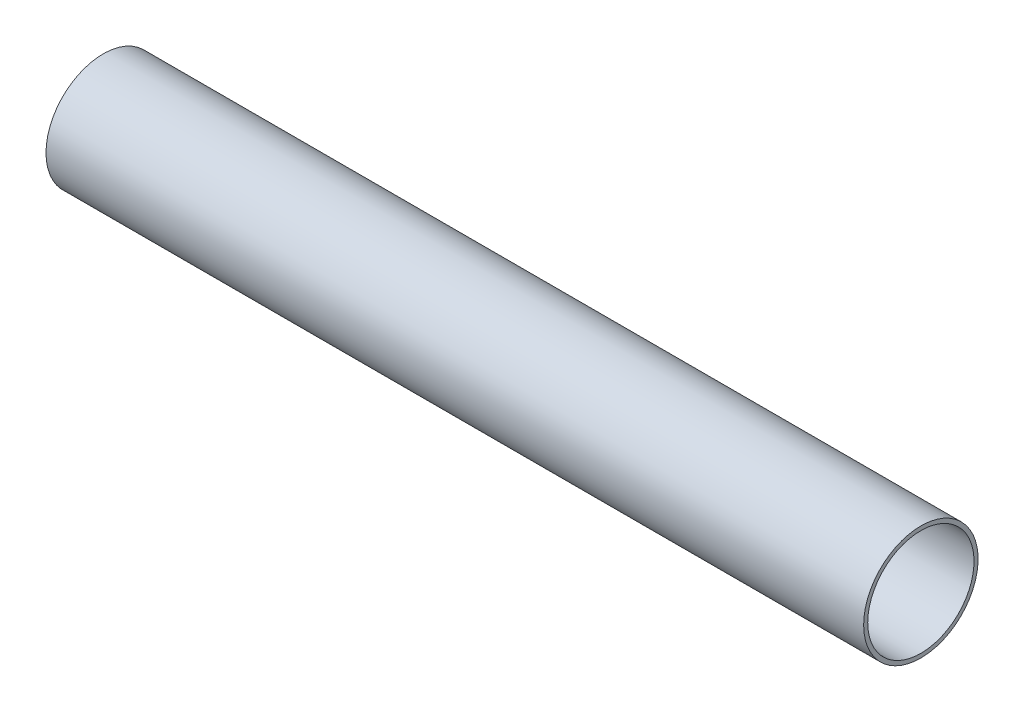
ISO-10303-21;
HEADER;
FILE_DESCRIPTION(('STEP AP214'),'2;1');
FILE_NAME('part.step','',(''),(''),'','','');
FILE_SCHEMA(('AUTOMOTIVE_DESIGN { 1 0 10303 214 1 1 1 1 }'));
ENDSEC;
DATA;
#1=APPLICATION_CONTEXT('core data for automotive mechanical design processes');
#2=APPLICATION_PROTOCOL_DEFINITION('international standard','automotive_design',2000,#1);
#3=PRODUCT_CONTEXT('',#1,'mechanical');
#4=PRODUCT('Part','Part','',(#3));
#5=PRODUCT_RELATED_PRODUCT_CATEGORY('part','',(#4));
#6=PRODUCT_DEFINITION_FORMATION('','',#4);
#7=PRODUCT_DEFINITION_CONTEXT('part definition',#1,'design');
#8=PRODUCT_DEFINITION('design','',#6,#7);
#9=PRODUCT_DEFINITION_SHAPE('','',#8);
#10=(LENGTH_UNIT() NAMED_UNIT(*) SI_UNIT(.MILLI.,.METRE.));
#11=(NAMED_UNIT(*) PLANE_ANGLE_UNIT() SI_UNIT($,.RADIAN.));
#12=(NAMED_UNIT(*) SI_UNIT($,.STERADIAN.) SOLID_ANGLE_UNIT());
#13=UNCERTAINTY_MEASURE_WITH_UNIT(LENGTH_MEASURE(1.E-05),#10,'distance_accuracy_value','');
#14=(GEOMETRIC_REPRESENTATION_CONTEXT(3) GLOBAL_UNCERTAINTY_ASSIGNED_CONTEXT((#13)) GLOBAL_UNIT_ASSIGNED_CONTEXT((#10,
#11,#12)) REPRESENTATION_CONTEXT('',''));
#15=CARTESIAN_POINT('',(0.,0.,0.));
#16=DIRECTION('',(0.,0.,1.));
#17=DIRECTION('',(1.,0.,0.));
#18=AXIS2_PLACEMENT_3D('',#15,#16,#17);
#19=CARTESIAN_POINT('',(0.,14.,0.));
#20=DIRECTION('',(1.,0.,0.));
#21=DIRECTION('',(0.,0.,-1.));
#22=AXIS2_PLACEMENT_3D('',#19,#20,#21);
#23=PLANE('',#22);
#24=CARTESIAN_POINT('',(0.,0.,0.));
#25=DIRECTION('',(-1.,0.,0.));
#26=DIRECTION('',(0.,0.,1.));
#27=AXIS2_PLACEMENT_3D('',#24,#25,#26);
#28=CIRCLE('',#27,13.);
#29=CARTESIAN_POINT('',(0.,0.,13.));
#30=VERTEX_POINT('',#29);
#31=EDGE_CURVE('E44',#30,#30,#28,.T.);
#32=ORIENTED_EDGE('',*,*,#31,.F.);
#33=EDGE_LOOP('',(#32));
#34=FACE_BOUND('',#33,.T.);
#35=CARTESIAN_POINT('',(0.,0.,0.));
#36=DIRECTION('',(-1.,0.,0.));
#37=DIRECTION('',(0.,0.,1.));
#38=AXIS2_PLACEMENT_3D('',#35,#36,#37);
#39=CIRCLE('',#38,14.);
#40=CARTESIAN_POINT('',(0.,0.,14.));
#41=VERTEX_POINT('',#40);
#42=EDGE_CURVE('E10',#41,#41,#39,.T.);
#43=ORIENTED_EDGE('',*,*,#42,.T.);
#44=EDGE_LOOP('',(#43));
#45=FACE_BOUND('',#44,.T.);
#46=ADVANCED_FACE('F30',(#34,#45),#23,.F.);
#47=CARTESIAN_POINT('',(0.,0.,0.));
#48=DIRECTION('',(-1.,0.,0.));
#49=DIRECTION('',(0.,0.,1.));
#50=AXIS2_PLACEMENT_3D('',#47,#48,#49);
#51=CYLINDRICAL_SURFACE('',#50,14.);
#52=CARTESIAN_POINT('',(200.,0.,0.));
#53=DIRECTION('',(-1.,0.,0.));
#54=DIRECTION('',(0.,0.,1.));
#55=AXIS2_PLACEMENT_3D('',#52,#53,#54);
#56=CIRCLE('',#55,14.);
#57=CARTESIAN_POINT('',(200.,0.,14.));
#58=VERTEX_POINT('',#57);
#59=EDGE_CURVE('E36',#58,#58,#56,.T.);
#60=ORIENTED_EDGE('',*,*,#59,.T.);
#61=EDGE_LOOP('',(#60));
#62=FACE_BOUND('',#61,.T.);
#63=ORIENTED_EDGE('',*,*,#42,.F.);
#64=EDGE_LOOP('',(#63));
#65=FACE_BOUND('',#64,.T.);
#66=ADVANCED_FACE('F54',(#62,#65),#51,.T.);
#67=CARTESIAN_POINT('',(200.,13.,0.));
#68=DIRECTION('',(-1.,0.,0.));
#69=DIRECTION('',(0.,0.,1.));
#70=AXIS2_PLACEMENT_3D('',#67,#68,#69);
#71=PLANE('',#70);
#72=ORIENTED_EDGE('',*,*,#59,.F.);
#73=EDGE_LOOP('',(#72));
#74=FACE_BOUND('',#73,.T.);
#75=CARTESIAN_POINT('',(200.,0.,0.));
#76=DIRECTION('',(-1.,0.,0.));
#77=DIRECTION('',(0.,0.,1.));
#78=AXIS2_PLACEMENT_3D('',#75,#76,#77);
#79=CIRCLE('',#78,13.);
#80=CARTESIAN_POINT('',(200.,0.,13.));
#81=VERTEX_POINT('',#80);
#82=EDGE_CURVE('E40',#81,#81,#79,.T.);
#83=ORIENTED_EDGE('',*,*,#82,.T.);
#84=EDGE_LOOP('',(#83));
#85=FACE_BOUND('',#84,.T.);
#86=ADVANCED_FACE('F58',(#74,#85),#71,.F.);
#87=CARTESIAN_POINT('',(0.,0.,0.));
#88=DIRECTION('',(-1.,0.,0.));
#89=DIRECTION('',(0.,0.,1.));
#90=AXIS2_PLACEMENT_3D('',#87,#88,#89);
#91=CYLINDRICAL_SURFACE('',#90,13.);
#92=ORIENTED_EDGE('',*,*,#31,.T.);
#93=EDGE_LOOP('',(#92));
#94=FACE_BOUND('',#93,.T.);
#95=ORIENTED_EDGE('',*,*,#82,.F.);
#96=EDGE_LOOP('',(#95));
#97=FACE_BOUND('',#96,.T.);
#98=ADVANCED_FACE('F50',(#94,#97),#91,.F.);
#99=CLOSED_SHELL('',(#46,#66,#86,#98));
#100=MANIFOLD_SOLID_BREP('B2',#99);
#101=ADVANCED_BREP_SHAPE_REPRESENTATION('',(#18,#100),#14);
#102=SHAPE_DEFINITION_REPRESENTATION(#9,#101);
ENDSEC;
END-ISO-10303-21;
